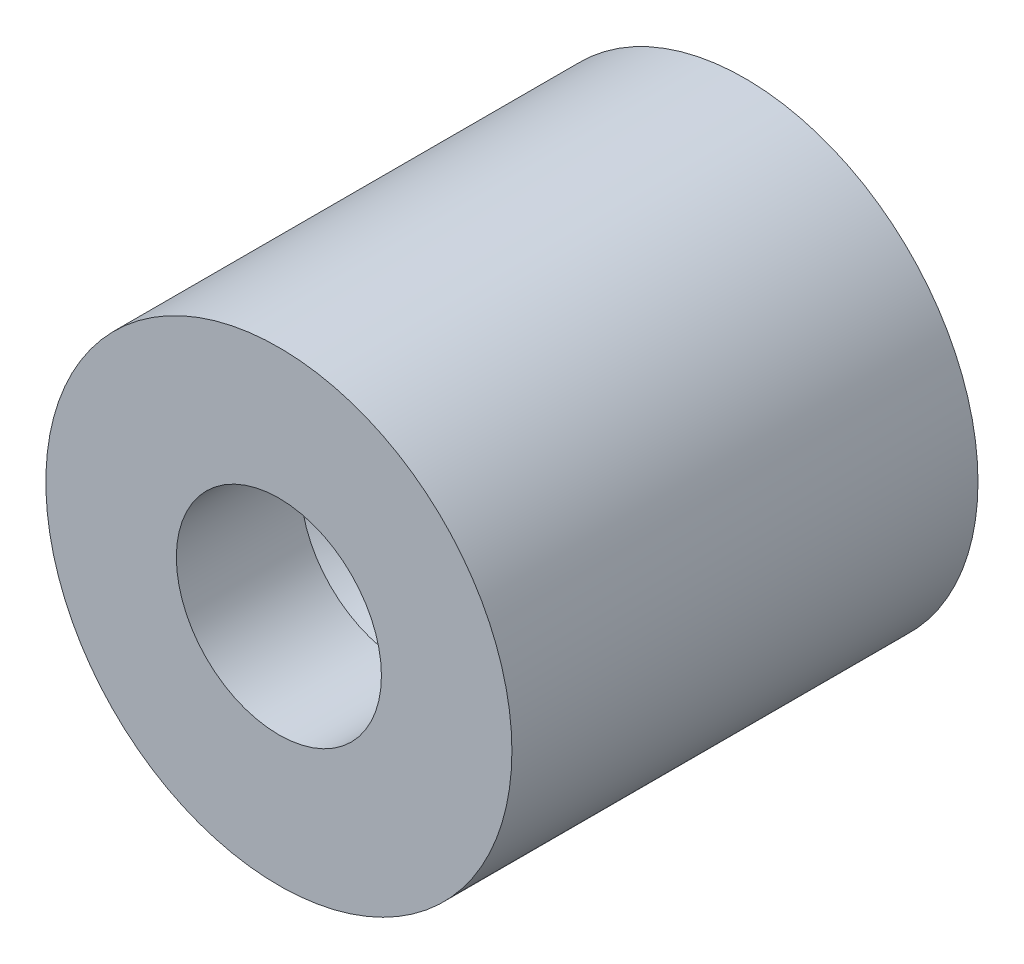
from build123d import *

# Parameters (mm, degrees)
ESQUISSE1_R          = 7.5
EXTRUSION1_DEPTH     = 15
D_GAGEMENT_M61_D     = 6.6
D_GAGEMENT_M61_DEPTH = 4
D_GAGEMENT_M61_TIP   = 1.982840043
D_GAGEMENT_M62_D     = 6.6
D_GAGEMENT_M62_DEPTH = 4
D_GAGEMENT_M62_TIP   = 1.982840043


with BuildPart() as part:
    # Esquisse1 → Extrusion1 (new body)
    with BuildSketch(Plane.XY):
        Circle(ESQUISSE1_R)
    extrude(amount=EXTRUSION1_DEPTH)

    # D_gagement M61
    with Locations(Plane.XY.offset(15)):
        with Locations((0, 0)):
            Hole(D_GAGEMENT_M61_D / 2, depth=D_GAGEMENT_M61_DEPTH)
            with Locations((0, 0, -(D_GAGEMENT_M61_DEPTH + D_GAGEMENT_M61_TIP / 2))):  # 118° drill point
                Cone(0, D_GAGEMENT_M61_D / 2, D_GAGEMENT_M61_TIP, mode=Mode.SUBTRACT)

    # D_gagement M62
    with Locations(Plane(origin=(0, 0, 0), x_dir=(-1, 0, 0), z_dir=(0, 0, -1))):
        with Locations((0, 0)):
            Hole(D_GAGEMENT_M62_D / 2, depth=D_GAGEMENT_M62_DEPTH)
            with Locations((0, 0, -(D_GAGEMENT_M62_DEPTH + D_GAGEMENT_M62_TIP / 2))):  # 118° drill point
                Cone(0, D_GAGEMENT_M62_D / 2, D_GAGEMENT_M62_TIP, mode=Mode.SUBTRACT)


solid = part.part
